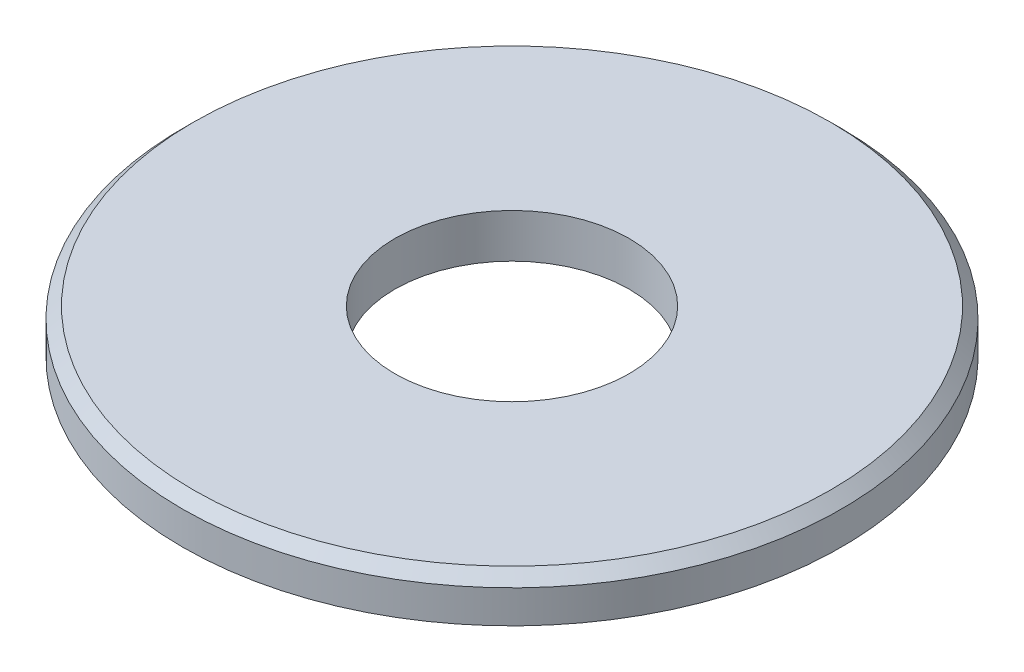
from build123d import *

# Parameters (mm, degrees)
ESQUISSE1_R          = 9
ESQUISSE1_R_2        = 3.2
BASE_EXTRUSION_DEPTH = 1.2
CHANFREIN3_SIZE      = 0.3


with BuildPart() as part:
    # Esquisse1 → Base-Extrusion (new body)
    with BuildSketch(Plane(origin=(0, 0, 0), x_dir=(1, 0, 0), z_dir=(0, 1, 0))):
        with Locations(Location((0, 0, 0), (0, 0, 270))):
            Circle(ESQUISSE1_R)
        with Locations(Location((0, 0, 0), (0, 0, 270))):
            Circle(ESQUISSE1_R_2, mode=Mode.SUBTRACT)
    extrude(amount=BASE_EXTRUSION_DEPTH)

    # Chanfrein3
    chanfrein3_edges = [part.edges().sort_by_distance(p)[0] for p in [
        (0, 1.2, -9),
    ]]
    chamfer(chanfrein3_edges, length=CHANFREIN3_SIZE)


solid = part.part
